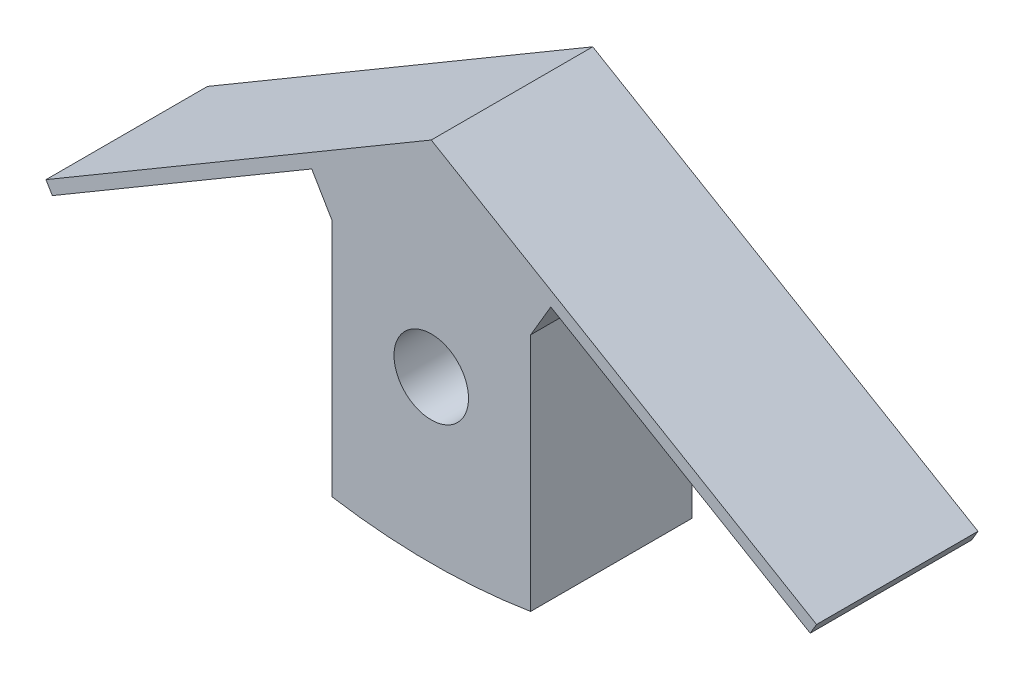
ISO-10303-21;
HEADER;
FILE_DESCRIPTION(('STEP AP214'),'2;1');
FILE_NAME('part.step','',(''),(''),'','','');
FILE_SCHEMA(('AUTOMOTIVE_DESIGN { 1 0 10303 214 1 1 1 1 }'));
ENDSEC;
DATA;
#1=APPLICATION_CONTEXT('core data for automotive mechanical design processes');
#2=APPLICATION_PROTOCOL_DEFINITION('international standard','automotive_design',2000,#1);
#3=PRODUCT_CONTEXT('',#1,'mechanical');
#4=PRODUCT('Part','Part','',(#3));
#5=PRODUCT_RELATED_PRODUCT_CATEGORY('part','',(#4));
#6=PRODUCT_DEFINITION_FORMATION('','',#4);
#7=PRODUCT_DEFINITION_CONTEXT('part definition',#1,'design');
#8=PRODUCT_DEFINITION('design','',#6,#7);
#9=PRODUCT_DEFINITION_SHAPE('','',#8);
#10=(LENGTH_UNIT() NAMED_UNIT(*) SI_UNIT(.MILLI.,.METRE.));
#11=(NAMED_UNIT(*) PLANE_ANGLE_UNIT() SI_UNIT($,.RADIAN.));
#12=(NAMED_UNIT(*) SI_UNIT($,.STERADIAN.) SOLID_ANGLE_UNIT());
#13=UNCERTAINTY_MEASURE_WITH_UNIT(LENGTH_MEASURE(1.E-05),#10,'distance_accuracy_value','');
#14=(GEOMETRIC_REPRESENTATION_CONTEXT(3) GLOBAL_UNCERTAINTY_ASSIGNED_CONTEXT((#13)) GLOBAL_UNIT_ASSIGNED_CONTEXT((#10,
#11,#12)) REPRESENTATION_CONTEXT('',''));
#15=CARTESIAN_POINT('',(0.,0.,0.));
#16=DIRECTION('',(0.,0.,1.));
#17=DIRECTION('',(1.,0.,0.));
#18=AXIS2_PLACEMENT_3D('',#15,#16,#17);
#19=CARTESIAN_POINT('',(0.,-0.482898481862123,13.));
#20=DIRECTION('',(0.507538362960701,-0.861629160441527,0.));
#21=DIRECTION('',(0.861629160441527,0.507538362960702,0.));
#22=AXIS2_PLACEMENT_3D('',#19,#20,#21);
#23=PLANE('',#22);
#24=DIRECTION('',(-0.861629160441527,-0.507538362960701,0.));
#25=VECTOR('',#24,1.);
#26=CARTESIAN_POINT('',(0.,-0.482898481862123,0.));
#27=LINE('',#26,#25);
#28=CARTESIAN_POINT('',(0.,-0.482898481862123,0.));
#29=VERTEX_POINT('',#28);
#30=CARTESIAN_POINT('',(-31.018649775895,-18.7542795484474,0.));
#31=VERTEX_POINT('',#30);
#32=EDGE_CURVE('E148',#29,#31,#27,.T.);
#33=ORIENTED_EDGE('',*,*,#32,.T.);
#34=DIRECTION('',(0.,0.,-1.));
#35=VECTOR('',#34,1.);
#36=CARTESIAN_POINT('',(-31.018649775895,-18.7542795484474,13.));
#37=LINE('',#36,#35);
#38=CARTESIAN_POINT('',(-31.018649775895,-18.7542795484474,13.));
#39=VERTEX_POINT('',#38);
#40=EDGE_CURVE('E11',#39,#31,#37,.T.);
#41=ORIENTED_EDGE('',*,*,#40,.F.);
#42=DIRECTION('',(-0.861629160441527,-0.507538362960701,0.));
#43=VECTOR('',#42,1.);
#44=CARTESIAN_POINT('',(0.,-0.482898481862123,13.));
#45=LINE('',#44,#43);
#46=CARTESIAN_POINT('',(0.,-0.482898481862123,13.));
#47=VERTEX_POINT('',#46);
#48=EDGE_CURVE('E169',#47,#39,#45,.T.);
#49=ORIENTED_EDGE('',*,*,#48,.F.);
#50=DIRECTION('',(0.,0.,-1.));
#51=VECTOR('',#50,1.);
#52=CARTESIAN_POINT('',(0.,-0.482898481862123,13.));
#53=LINE('',#52,#51);
#54=EDGE_CURVE('E144',#47,#29,#53,.T.);
#55=ORIENTED_EDGE('',*,*,#54,.T.);
#56=EDGE_LOOP('',(#33,#41,#49,#55));
#57=FACE_BOUND('',#56,.T.);
#58=ADVANCED_FACE('F33',(#57),#23,.F.);
#59=CARTESIAN_POINT('',(-31.018649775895,-18.7542795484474,13.));
#60=DIRECTION('',(0.861629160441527,0.507538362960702,0.));
#61=DIRECTION('',(-0.507538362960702,0.861629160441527,0.));
#62=AXIS2_PLACEMENT_3D('',#59,#60,#61);
#63=PLANE('',#62);
#64=DIRECTION('',(0.507538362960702,-0.861629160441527,0.));
#65=VECTOR('',#64,1.);
#66=CARTESIAN_POINT('',(-31.018649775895,-18.7542795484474,0.));
#67=LINE('',#66,#65);
#68=CARTESIAN_POINT('',(-30.5111114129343,-19.6159087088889,0.));
#69=VERTEX_POINT('',#68);
#70=EDGE_CURVE('E151',#31,#69,#67,.T.);
#71=ORIENTED_EDGE('',*,*,#70,.T.);
#72=DIRECTION('',(0.,0.,-1.));
#73=VECTOR('',#72,1.);
#74=CARTESIAN_POINT('',(-30.5111114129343,-19.6159087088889,13.));
#75=LINE('',#74,#73);
#76=CARTESIAN_POINT('',(-30.5111114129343,-19.6159087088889,13.));
#77=VERTEX_POINT('',#76);
#78=EDGE_CURVE('E42',#77,#69,#75,.T.);
#79=ORIENTED_EDGE('',*,*,#78,.F.);
#80=DIRECTION('',(0.507538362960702,-0.861629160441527,0.));
#81=VECTOR('',#80,1.);
#82=CARTESIAN_POINT('',(-31.018649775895,-18.7542795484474,13.));
#83=LINE('',#82,#81);
#84=EDGE_CURVE('E102',#39,#77,#83,.T.);
#85=ORIENTED_EDGE('',*,*,#84,.F.);
#86=ORIENTED_EDGE('',*,*,#40,.T.);
#87=EDGE_LOOP('',(#71,#79,#85,#86));
#88=FACE_BOUND('',#87,.T.);
#89=ADVANCED_FACE('F243',(#88),#63,.F.);
#90=CARTESIAN_POINT('',(-30.5111114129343,-19.6159087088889,13.));
#91=DIRECTION('',(-0.507538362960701,0.861629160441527,0.));
#92=DIRECTION('',(-0.861629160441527,-0.507538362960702,0.));
#93=AXIS2_PLACEMENT_3D('',#90,#91,#92);
#94=PLANE('',#93);
#95=DIRECTION('',(0.861629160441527,0.507538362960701,0.));
#96=VECTOR('',#95,1.);
#97=CARTESIAN_POINT('',(-30.5111114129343,-19.6159087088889,0.));
#98=LINE('',#97,#96);
#99=CARTESIAN_POINT('',(-9.62304654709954,-7.31189819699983,0.));
#100=VERTEX_POINT('',#99);
#101=EDGE_CURVE('E154',#69,#100,#98,.T.);
#102=ORIENTED_EDGE('',*,*,#101,.T.);
#103=DIRECTION('',(0.,0.,-1.));
#104=VECTOR('',#103,1.);
#105=CARTESIAN_POINT('',(-9.62304654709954,-7.31189819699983,13.));
#106=LINE('',#105,#104);
#107=CARTESIAN_POINT('',(-9.62304654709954,-7.31189819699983,13.));
#108=VERTEX_POINT('',#107);
#109=EDGE_CURVE('E185',#108,#100,#106,.T.);
#110=ORIENTED_EDGE('',*,*,#109,.F.);
#111=DIRECTION('',(0.861629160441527,0.507538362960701,0.));
#112=VECTOR('',#111,1.);
#113=CARTESIAN_POINT('',(-30.5111114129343,-19.6159087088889,13.));
#114=LINE('',#113,#112);
#115=EDGE_CURVE('E194',#77,#108,#114,.T.);
#116=ORIENTED_EDGE('',*,*,#115,.F.);
#117=ORIENTED_EDGE('',*,*,#78,.T.);
#118=EDGE_LOOP('',(#102,#110,#116,#117));
#119=FACE_BOUND('',#118,.T.);
#120=ADVANCED_FACE('F192',(#119),#94,.F.);
#121=CARTESIAN_POINT('',(-9.62304654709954,-7.31189819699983,13.));
#122=DIRECTION('',(0.861629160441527,0.507538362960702,0.));
#123=DIRECTION('',(-0.507538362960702,0.861629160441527,0.));
#124=AXIS2_PLACEMENT_3D('',#121,#122,#123);
#125=PLANE('',#124);
#126=DIRECTION('',(0.507538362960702,-0.861629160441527,0.));
#127=VECTOR('',#126,1.);
#128=CARTESIAN_POINT('',(-9.62304654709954,-7.31189819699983,0.));
#129=LINE('',#128,#127);
#130=CARTESIAN_POINT('',(-8.,-10.0672844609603,0.));
#131=VERTEX_POINT('',#130);
#132=EDGE_CURVE('E156',#100,#131,#129,.T.);
#133=ORIENTED_EDGE('',*,*,#132,.T.);
#134=DIRECTION('',(0.,0.,-1.));
#135=VECTOR('',#134,1.);
#136=CARTESIAN_POINT('',(-8.,-10.0672844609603,13.));
#137=LINE('',#136,#135);
#138=CARTESIAN_POINT('',(-8.,-10.0672844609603,13.));
#139=VERTEX_POINT('',#138);
#140=EDGE_CURVE('E182',#139,#131,#137,.T.);
#141=ORIENTED_EDGE('',*,*,#140,.F.);
#142=DIRECTION('',(0.507538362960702,-0.861629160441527,0.));
#143=VECTOR('',#142,1.);
#144=CARTESIAN_POINT('',(-9.62304654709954,-7.31189819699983,13.));
#145=LINE('',#144,#143);
#146=EDGE_CURVE('E212',#108,#139,#145,.T.);
#147=ORIENTED_EDGE('',*,*,#146,.F.);
#148=ORIENTED_EDGE('',*,*,#109,.T.);
#149=EDGE_LOOP('',(#133,#141,#147,#148));
#150=FACE_BOUND('',#149,.T.);
#151=ADVANCED_FACE('F203',(#150),#125,.F.);
#152=CARTESIAN_POINT('',(-8.,-10.0672844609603,13.));
#153=DIRECTION('',(1.,0.,0.));
#154=DIRECTION('',(0.,1.,0.));
#155=AXIS2_PLACEMENT_3D('',#152,#153,#154);
#156=PLANE('',#155);
#157=DIRECTION('',(0.,-1.,0.));
#158=VECTOR('',#157,1.);
#159=CARTESIAN_POINT('',(-8.,-10.0672844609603,0.));
#160=LINE('',#159,#158);
#161=CARTESIAN_POINT('',(-8.00000000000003,-29.3558507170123,0.));
#162=VERTEX_POINT('',#161);
#163=EDGE_CURVE('E158',#131,#162,#160,.T.);
#164=ORIENTED_EDGE('',*,*,#163,.T.);
#165=DIRECTION('',(0.,0.,-1.));
#166=VECTOR('',#165,1.);
#167=CARTESIAN_POINT('',(-8.00000000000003,-29.3558507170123,13.));
#168=LINE('',#167,#166);
#169=CARTESIAN_POINT('',(-8.00000000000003,-29.3558507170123,13.));
#170=VERTEX_POINT('',#169);
#171=EDGE_CURVE('E179',#170,#162,#168,.T.);
#172=ORIENTED_EDGE('',*,*,#171,.F.);
#173=DIRECTION('',(0.,-1.,0.));
#174=VECTOR('',#173,1.);
#175=CARTESIAN_POINT('',(-8.,-10.0672844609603,13.));
#176=LINE('',#175,#174);
#177=EDGE_CURVE('E209',#139,#170,#176,.T.);
#178=ORIENTED_EDGE('',*,*,#177,.F.);
#179=ORIENTED_EDGE('',*,*,#140,.T.);
#180=EDGE_LOOP('',(#164,#172,#178,#179));
#181=FACE_BOUND('',#180,.T.);
#182=ADVANCED_FACE('F207',(#181),#156,.F.);
#183=CARTESIAN_POINT('',(0.,20.,13.));
#184=DIRECTION('',(0.,0.,-1.));
#185=DIRECTION('',(-1.,0.,0.));
#186=AXIS2_PLACEMENT_3D('',#183,#184,#185);
#187=CYLINDRICAL_SURFACE('',#186,50.);
#188=CARTESIAN_POINT('',(0.,20.,0.));
#189=DIRECTION('',(0.,0.,1.));
#190=DIRECTION('',(1.,0.,0.));
#191=AXIS2_PLACEMENT_3D('',#188,#189,#190);
#192=CIRCLE('',#191,50.);
#193=CARTESIAN_POINT('',(8.00000000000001,-29.3558507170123,0.));
#194=VERTEX_POINT('',#193);
#195=EDGE_CURVE('E160',#162,#194,#192,.T.);
#196=ORIENTED_EDGE('',*,*,#195,.T.);
#197=DIRECTION('',(0.,0.,-1.));
#198=VECTOR('',#197,1.);
#199=CARTESIAN_POINT('',(8.00000000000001,-29.3558507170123,13.));
#200=LINE('',#199,#198);
#201=CARTESIAN_POINT('',(8.00000000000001,-29.3558507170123,13.));
#202=VERTEX_POINT('',#201);
#203=EDGE_CURVE('E176',#202,#194,#200,.T.);
#204=ORIENTED_EDGE('',*,*,#203,.F.);
#205=CARTESIAN_POINT('',(0.,20.,13.));
#206=DIRECTION('',(0.,0.,1.));
#207=DIRECTION('',(1.,0.,0.));
#208=AXIS2_PLACEMENT_3D('',#205,#206,#207);
#209=CIRCLE('',#208,50.);
#210=EDGE_CURVE('E211',#170,#202,#209,.T.);
#211=ORIENTED_EDGE('',*,*,#210,.F.);
#212=ORIENTED_EDGE('',*,*,#171,.T.);
#213=EDGE_LOOP('',(#196,#204,#211,#212));
#214=FACE_BOUND('',#213,.T.);
#215=ADVANCED_FACE('F256',(#214),#187,.T.);
#216=CARTESIAN_POINT('',(8.,-10.0672844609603,13.));
#217=DIRECTION('',(-1.,0.,0.));
#218=DIRECTION('',(0.,-1.,0.));
#219=AXIS2_PLACEMENT_3D('',#216,#217,#218);
#220=PLANE('',#219);
#221=DIRECTION('',(0.,1.,0.));
#222=VECTOR('',#221,1.);
#223=CARTESIAN_POINT('',(8.,-10.0672844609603,0.));
#224=LINE('',#223,#222);
#225=CARTESIAN_POINT('',(8.,-10.0672844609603,0.));
#226=VERTEX_POINT('',#225);
#227=EDGE_CURVE('E162',#194,#226,#224,.T.);
#228=ORIENTED_EDGE('',*,*,#227,.T.);
#229=DIRECTION('',(0.,0.,-1.));
#230=VECTOR('',#229,1.);
#231=CARTESIAN_POINT('',(8.,-10.0672844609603,13.));
#232=LINE('',#231,#230);
#233=CARTESIAN_POINT('',(8.,-10.0672844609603,13.));
#234=VERTEX_POINT('',#233);
#235=EDGE_CURVE('E173',#234,#226,#232,.T.);
#236=ORIENTED_EDGE('',*,*,#235,.F.);
#237=DIRECTION('',(0.,1.,0.));
#238=VECTOR('',#237,1.);
#239=CARTESIAN_POINT('',(8.,-10.0672844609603,13.));
#240=LINE('',#239,#238);
#241=EDGE_CURVE('E214',#202,#234,#240,.T.);
#242=ORIENTED_EDGE('',*,*,#241,.F.);
#243=ORIENTED_EDGE('',*,*,#203,.T.);
#244=EDGE_LOOP('',(#228,#236,#242,#243));
#245=FACE_BOUND('',#244,.T.);
#246=ADVANCED_FACE('F223',(#245),#220,.F.);
#247=CARTESIAN_POINT('',(9.62304654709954,-7.31189819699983,13.));
#248=DIRECTION('',(-0.861629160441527,0.507538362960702,0.));
#249=DIRECTION('',(-0.507538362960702,-0.861629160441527,0.));
#250=AXIS2_PLACEMENT_3D('',#247,#248,#249);
#251=PLANE('',#250);
#252=DIRECTION('',(0.507538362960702,0.861629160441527,0.));
#253=VECTOR('',#252,1.);
#254=CARTESIAN_POINT('',(9.62304654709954,-7.31189819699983,0.));
#255=LINE('',#254,#253);
#256=CARTESIAN_POINT('',(9.62304654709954,-7.31189819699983,0.));
#257=VERTEX_POINT('',#256);
#258=EDGE_CURVE('E164',#226,#257,#255,.T.);
#259=ORIENTED_EDGE('',*,*,#258,.T.);
#260=DIRECTION('',(0.,0.,-1.));
#261=VECTOR('',#260,1.);
#262=CARTESIAN_POINT('',(9.62304654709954,-7.31189819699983,13.));
#263=LINE('',#262,#261);
#264=CARTESIAN_POINT('',(9.62304654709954,-7.31189819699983,13.));
#265=VERTEX_POINT('',#264);
#266=EDGE_CURVE('E139',#265,#257,#263,.T.);
#267=ORIENTED_EDGE('',*,*,#266,.F.);
#268=DIRECTION('',(0.507538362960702,0.861629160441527,0.));
#269=VECTOR('',#268,1.);
#270=CARTESIAN_POINT('',(9.62304654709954,-7.31189819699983,13.));
#271=LINE('',#270,#269);
#272=EDGE_CURVE('E130',#234,#265,#271,.T.);
#273=ORIENTED_EDGE('',*,*,#272,.F.);
#274=ORIENTED_EDGE('',*,*,#235,.T.);
#275=EDGE_LOOP('',(#259,#267,#273,#274));
#276=FACE_BOUND('',#275,.T.);
#277=ADVANCED_FACE('F227',(#276),#251,.F.);
#278=CARTESIAN_POINT('',(30.5111114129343,-19.6159087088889,13.));
#279=DIRECTION('',(0.507538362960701,0.861629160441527,0.));
#280=DIRECTION('',(-0.861629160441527,0.507538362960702,0.));
#281=AXIS2_PLACEMENT_3D('',#278,#279,#280);
#282=PLANE('',#281);
#283=DIRECTION('',(0.861629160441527,-0.507538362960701,0.));
#284=VECTOR('',#283,1.);
#285=CARTESIAN_POINT('',(30.5111114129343,-19.6159087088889,0.));
#286=LINE('',#285,#284);
#287=CARTESIAN_POINT('',(30.5111114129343,-19.6159087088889,0.));
#288=VERTEX_POINT('',#287);
#289=EDGE_CURVE('E138',#257,#288,#286,.T.);
#290=ORIENTED_EDGE('',*,*,#289,.T.);
#291=DIRECTION('',(0.,0.,-1.));
#292=VECTOR('',#291,1.);
#293=CARTESIAN_POINT('',(30.5111114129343,-19.6159087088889,13.));
#294=LINE('',#293,#292);
#295=CARTESIAN_POINT('',(30.5111114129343,-19.6159087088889,13.));
#296=VERTEX_POINT('',#295);
#297=EDGE_CURVE('E135',#296,#288,#294,.T.);
#298=ORIENTED_EDGE('',*,*,#297,.F.);
#299=DIRECTION('',(0.861629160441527,-0.507538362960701,0.));
#300=VECTOR('',#299,1.);
#301=CARTESIAN_POINT('',(30.5111114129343,-19.6159087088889,13.));
#302=LINE('',#301,#300);
#303=EDGE_CURVE('E124',#265,#296,#302,.T.);
#304=ORIENTED_EDGE('',*,*,#303,.F.);
#305=ORIENTED_EDGE('',*,*,#266,.T.);
#306=EDGE_LOOP('',(#290,#298,#304,#305));
#307=FACE_BOUND('',#306,.T.);
#308=ADVANCED_FACE('F136',(#307),#282,.F.);
#309=CARTESIAN_POINT('',(31.018649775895,-18.7542795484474,13.));
#310=DIRECTION('',(-0.861629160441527,0.507538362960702,0.));
#311=DIRECTION('',(-0.507538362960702,-0.861629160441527,0.));
#312=AXIS2_PLACEMENT_3D('',#309,#310,#311);
#313=PLANE('',#312);
#314=DIRECTION('',(0.507538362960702,0.861629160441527,0.));
#315=VECTOR('',#314,1.);
#316=CARTESIAN_POINT('',(31.018649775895,-18.7542795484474,0.));
#317=LINE('',#316,#315);
#318=CARTESIAN_POINT('',(31.018649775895,-18.7542795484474,0.));
#319=VERTEX_POINT('',#318);
#320=EDGE_CURVE('E88',#288,#319,#317,.T.);
#321=ORIENTED_EDGE('',*,*,#320,.T.);
#322=DIRECTION('',(0.,0.,-1.));
#323=VECTOR('',#322,1.);
#324=CARTESIAN_POINT('',(31.018649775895,-18.7542795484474,13.));
#325=LINE('',#324,#323);
#326=CARTESIAN_POINT('',(31.018649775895,-18.7542795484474,13.));
#327=VERTEX_POINT('',#326);
#328=EDGE_CURVE('E140',#327,#319,#325,.T.);
#329=ORIENTED_EDGE('',*,*,#328,.F.);
#330=DIRECTION('',(0.507538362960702,0.861629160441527,0.));
#331=VECTOR('',#330,1.);
#332=CARTESIAN_POINT('',(31.018649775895,-18.7542795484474,13.));
#333=LINE('',#332,#331);
#334=EDGE_CURVE('E128',#296,#327,#333,.T.);
#335=ORIENTED_EDGE('',*,*,#334,.F.);
#336=ORIENTED_EDGE('',*,*,#297,.T.);
#337=EDGE_LOOP('',(#321,#329,#335,#336));
#338=FACE_BOUND('',#337,.T.);
#339=ADVANCED_FACE('F142',(#338),#313,.F.);
#340=CARTESIAN_POINT('',(0.,-0.482898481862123,13.));
#341=DIRECTION('',(-0.507538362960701,-0.861629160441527,0.));
#342=DIRECTION('',(0.861629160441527,-0.507538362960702,0.));
#343=AXIS2_PLACEMENT_3D('',#340,#341,#342);
#344=PLANE('',#343);
#345=DIRECTION('',(-0.861629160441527,0.507538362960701,0.));
#346=VECTOR('',#345,1.);
#347=CARTESIAN_POINT('',(0.,-0.482898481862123,0.));
#348=LINE('',#347,#346);
#349=EDGE_CURVE('E94',#319,#29,#348,.T.);
#350=ORIENTED_EDGE('',*,*,#349,.T.);
#351=ORIENTED_EDGE('',*,*,#54,.F.);
#352=DIRECTION('',(-0.861629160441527,0.507538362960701,0.));
#353=VECTOR('',#352,1.);
#354=CARTESIAN_POINT('',(0.,-0.482898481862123,13.));
#355=LINE('',#354,#353);
#356=EDGE_CURVE('E50',#327,#47,#355,.T.);
#357=ORIENTED_EDGE('',*,*,#356,.F.);
#358=ORIENTED_EDGE('',*,*,#328,.T.);
#359=EDGE_LOOP('',(#350,#351,#357,#358));
#360=FACE_BOUND('',#359,.T.);
#361=ADVANCED_FACE('F231',(#360),#344,.F.);
#362=CARTESIAN_POINT('',(0.,20.,13.));
#363=DIRECTION('',(0.,0.,1.));
#364=DIRECTION('',(1.,0.,0.));
#365=AXIS2_PLACEMENT_3D('',#362,#363,#364);
#366=PLANE('',#365);
#367=CARTESIAN_POINT('',(0.,-17.,13.));
#368=DIRECTION('',(0.,0.,-1.));
#369=DIRECTION('',(-1.,0.,0.));
#370=AXIS2_PLACEMENT_3D('',#367,#368,#369);
#371=CIRCLE('',#370,3.);
#372=CARTESIAN_POINT('',(-3.,-17.,13.));
#373=VERTEX_POINT('',#372);
#374=EDGE_CURVE('E328',#373,#373,#371,.T.);
#375=ORIENTED_EDGE('',*,*,#374,.T.);
#376=EDGE_LOOP('',(#375));
#377=FACE_BOUND('',#376,.T.);
#378=ORIENTED_EDGE('',*,*,#48,.T.);
#379=ORIENTED_EDGE('',*,*,#84,.T.);
#380=ORIENTED_EDGE('',*,*,#115,.T.);
#381=ORIENTED_EDGE('',*,*,#146,.T.);
#382=ORIENTED_EDGE('',*,*,#177,.T.);
#383=ORIENTED_EDGE('',*,*,#210,.T.);
#384=ORIENTED_EDGE('',*,*,#241,.T.);
#385=ORIENTED_EDGE('',*,*,#272,.T.);
#386=ORIENTED_EDGE('',*,*,#303,.T.);
#387=ORIENTED_EDGE('',*,*,#334,.T.);
#388=ORIENTED_EDGE('',*,*,#356,.T.);
#389=EDGE_LOOP('',(#378,#379,#380,#381,#382,#383,#384,#385,#386,#387,#388));
#390=FACE_BOUND('',#389,.T.);
#391=ADVANCED_FACE('F126',(#377,#390),#366,.T.);
#392=CARTESIAN_POINT('',(0.,20.,0.));
#393=DIRECTION('',(0.,0.,1.));
#394=DIRECTION('',(1.,0.,0.));
#395=AXIS2_PLACEMENT_3D('',#392,#393,#394);
#396=PLANE('',#395);
#397=CARTESIAN_POINT('',(0.,-17.,0.));
#398=DIRECTION('',(0.,0.,1.));
#399=DIRECTION('',(1.,0.,0.));
#400=AXIS2_PLACEMENT_3D('',#397,#398,#399);
#401=CIRCLE('',#400,3.);
#402=CARTESIAN_POINT('',(-3.,-17.,0.));
#403=VERTEX_POINT('',#402);
#404=EDGE_CURVE('E36',#403,#403,#401,.T.);
#405=ORIENTED_EDGE('',*,*,#404,.T.);
#406=EDGE_LOOP('',(#405));
#407=FACE_BOUND('',#406,.T.);
#408=CARTESIAN_POINT('',(0.,-26.,0.));
#409=DIRECTION('',(0.,0.,1.));
#410=DIRECTION('',(1.,0.,0.));
#411=AXIS2_PLACEMENT_3D('',#408,#409,#410);
#412=CIRCLE('',#411,2.);
#413=CARTESIAN_POINT('',(2.,-26.,0.));
#414=VERTEX_POINT('',#413);
#415=EDGE_CURVE('E331',#414,#414,#412,.T.);
#416=ORIENTED_EDGE('',*,*,#415,.T.);
#417=EDGE_LOOP('',(#416));
#418=FACE_BOUND('',#417,.T.);
#419=ORIENTED_EDGE('',*,*,#32,.F.);
#420=ORIENTED_EDGE('',*,*,#349,.F.);
#421=ORIENTED_EDGE('',*,*,#320,.F.);
#422=ORIENTED_EDGE('',*,*,#289,.F.);
#423=ORIENTED_EDGE('',*,*,#258,.F.);
#424=ORIENTED_EDGE('',*,*,#227,.F.);
#425=ORIENTED_EDGE('',*,*,#195,.F.);
#426=ORIENTED_EDGE('',*,*,#163,.F.);
#427=ORIENTED_EDGE('',*,*,#132,.F.);
#428=ORIENTED_EDGE('',*,*,#101,.F.);
#429=ORIENTED_EDGE('',*,*,#70,.F.);
#430=EDGE_LOOP('',(#419,#420,#421,#422,#423,#424,#425,#426,#427,#428,#429));
#431=FACE_BOUND('',#430,.T.);
#432=ADVANCED_FACE('F198',(#407,#418,#431),#396,.F.);
#433=CARTESIAN_POINT('',(0.,-26.,-13.));
#434=DIRECTION('',(0.,0.,1.));
#435=DIRECTION('',(1.,0.,0.));
#436=AXIS2_PLACEMENT_3D('',#433,#434,#435);
#437=CYLINDRICAL_SURFACE('',#436,2.);
#438=CARTESIAN_POINT('',(0.,-26.,-13.));
#439=DIRECTION('',(0.,0.,1.));
#440=DIRECTION('',(1.,0.,0.));
#441=AXIS2_PLACEMENT_3D('',#438,#439,#440);
#442=CIRCLE('',#441,2.);
#443=CARTESIAN_POINT('',(2.,-26.,-13.));
#444=VERTEX_POINT('',#443);
#445=EDGE_CURVE('E152',#444,#444,#442,.T.);
#446=CARTESIAN_POINT('',(2.,-26.,-13.));
#447=CARTESIAN_POINT('',(2.,-26.,-12.8645833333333));
#448=CARTESIAN_POINT('',(2.,-26.,-12.7291666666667));
#449=CARTESIAN_POINT('',(2.,-26.,-12.4583333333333));
#450=CARTESIAN_POINT('',(2.,-26.,-12.3229166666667));
#451=CARTESIAN_POINT('',(2.,-26.,-12.0520833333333));
#452=CARTESIAN_POINT('',(2.,-26.,-11.9166666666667));
#453=CARTESIAN_POINT('',(2.,-26.,-11.6458333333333));
#454=CARTESIAN_POINT('',(2.,-26.,-11.5104166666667));
#455=CARTESIAN_POINT('',(2.,-26.,-11.2395833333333));
#456=CARTESIAN_POINT('',(2.,-26.,-11.1041666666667));
#457=CARTESIAN_POINT('',(2.,-26.,-10.8333333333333));
#458=CARTESIAN_POINT('',(2.,-26.,-10.6979166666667));
#459=CARTESIAN_POINT('',(2.,-26.,-10.4270833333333));
#460=CARTESIAN_POINT('',(2.,-26.,-10.2916666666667));
#461=CARTESIAN_POINT('',(2.,-26.,-10.0208333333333));
#462=CARTESIAN_POINT('',(2.,-26.,-9.88541666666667));
#463=CARTESIAN_POINT('',(2.,-26.,-9.61458333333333));
#464=CARTESIAN_POINT('',(2.,-26.,-9.47916666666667));
#465=CARTESIAN_POINT('',(2.,-26.,-9.20833333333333));
#466=CARTESIAN_POINT('',(2.,-26.,-9.07291666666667));
#467=CARTESIAN_POINT('',(2.,-26.,-8.80208333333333));
#468=CARTESIAN_POINT('',(2.,-26.,-8.66666666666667));
#469=CARTESIAN_POINT('',(2.,-26.,-8.39583333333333));
#470=CARTESIAN_POINT('',(2.,-26.,-8.26041666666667));
#471=CARTESIAN_POINT('',(2.,-26.,-7.98958333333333));
#472=CARTESIAN_POINT('',(2.,-26.,-7.85416666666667));
#473=CARTESIAN_POINT('',(2.,-26.,-7.58333333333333));
#474=CARTESIAN_POINT('',(2.,-26.,-7.44791666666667));
#475=CARTESIAN_POINT('',(2.,-26.,-7.17708333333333));
#476=CARTESIAN_POINT('',(2.,-26.,-7.04166666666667));
#477=CARTESIAN_POINT('',(2.,-26.,-6.77083333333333));
#478=CARTESIAN_POINT('',(2.,-26.,-6.63541666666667));
#479=CARTESIAN_POINT('',(2.,-26.,-6.36458333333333));
#480=CARTESIAN_POINT('',(2.,-26.,-6.22916666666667));
#481=CARTESIAN_POINT('',(2.,-26.,-5.95833333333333));
#482=CARTESIAN_POINT('',(2.,-26.,-5.82291666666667));
#483=CARTESIAN_POINT('',(2.,-26.,-5.55208333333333));
#484=CARTESIAN_POINT('',(2.,-26.,-5.41666666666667));
#485=CARTESIAN_POINT('',(2.,-26.,-5.14583333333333));
#486=CARTESIAN_POINT('',(2.,-26.,-5.01041666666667));
#487=CARTESIAN_POINT('',(2.,-26.,-4.73958333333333));
#488=CARTESIAN_POINT('',(2.,-26.,-4.60416666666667));
#489=CARTESIAN_POINT('',(2.,-26.,-4.33333333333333));
#490=CARTESIAN_POINT('',(2.,-26.,-4.19791666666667));
#491=CARTESIAN_POINT('',(2.,-26.,-3.92708333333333));
#492=CARTESIAN_POINT('',(2.,-26.,-3.79166666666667));
#493=CARTESIAN_POINT('',(2.,-26.,-3.52083333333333));
#494=CARTESIAN_POINT('',(2.,-26.,-3.38541666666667));
#495=CARTESIAN_POINT('',(2.,-26.,-3.11458333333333));
#496=CARTESIAN_POINT('',(2.,-26.,-2.97916666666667));
#497=CARTESIAN_POINT('',(2.,-26.,-2.70833333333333));
#498=CARTESIAN_POINT('',(2.,-26.,-2.57291666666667));
#499=CARTESIAN_POINT('',(2.,-26.,-2.30208333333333));
#500=CARTESIAN_POINT('',(2.,-26.,-2.16666666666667));
#501=CARTESIAN_POINT('',(2.,-26.,-1.89583333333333));
#502=CARTESIAN_POINT('',(2.,-26.,-1.76041666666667));
#503=CARTESIAN_POINT('',(2.,-26.,-1.48958333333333));
#504=CARTESIAN_POINT('',(2.,-26.,-1.35416666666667));
#505=CARTESIAN_POINT('',(2.,-26.,-1.08333333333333));
#506=CARTESIAN_POINT('',(2.,-26.,-0.947916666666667));
#507=CARTESIAN_POINT('',(2.,-26.,-0.677083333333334));
#508=CARTESIAN_POINT('',(2.,-26.,-0.541666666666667));
#509=CARTESIAN_POINT('',(2.,-26.,-0.270833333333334));
#510=CARTESIAN_POINT('',(2.,-26.,-0.135416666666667));
#511=CARTESIAN_POINT('',(2.,-26.,0.));
#512=B_SPLINE_CURVE_WITH_KNOTS('',3,(#446,#447,#448,#449,#450,#451,#452,#453,#454,#455,#456,
#457,#458,#459,#460,#461,#462,#463,#464,#465,#466,#467,#468,#469,#470,#471,#472,#473,#474,#475,
#476,#477,#478,#479,#480,#481,#482,#483,#484,#485,#486,#487,#488,#489,#490,#491,#492,#493,#494,
#495,#496,#497,#498,#499,#500,#501,#502,#503,#504,#505,#506,#507,#508,#509,#510,#511),
.UNSPECIFIED.,.F.,.F.,(4,2,2,2,2,2,2,2,2,2,2,2,2,2,2,2,2,2,2,2,2,2,2,2,2,2,2,2,2,2,2,2,4),(0.,
0.40625,0.812500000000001,1.21875,1.625,2.03125,2.4375,2.84375,3.25,3.65625,4.0625,4.46875,
4.875,5.28125,5.6875,6.09375,6.5,6.90625,7.3125,7.71875,8.125,8.53125,8.9375,9.34375,9.75,
10.15625,10.5625,10.96875,11.375,11.78125,12.1875,12.59375,13.),.UNSPECIFIED.);
#513=EDGE_CURVE('BSEAM283',#444,#414,#512,.T.);
#514=ORIENTED_EDGE('',*,*,#445,.T.);
#515=ORIENTED_EDGE('',*,*,#415,.F.);
#516=ORIENTED_EDGE('',*,*,#513,.T.);
#517=ORIENTED_EDGE('',*,*,#513,.F.);
#518=EDGE_LOOP('',(#514,#516,#515,#517));
#519=FACE_BOUND('',#518,.T.);
#520=ADVANCED_FACE('F283',(#519),#437,.T.);
#521=CARTESIAN_POINT('',(0.,-26.,-13.));
#522=DIRECTION('',(0.,0.,1.));
#523=DIRECTION('',(1.,0.,0.));
#524=AXIS2_PLACEMENT_3D('',#521,#522,#523);
#525=PLANE('',#524);
#526=ORIENTED_EDGE('',*,*,#445,.F.);
#527=EDGE_LOOP('',(#526));
#528=FACE_BOUND('',#527,.T.);
#529=ADVANCED_FACE('F288',(#528),#525,.F.);
#530=CARTESIAN_POINT('',(0.,-17.,13.));
#531=DIRECTION('',(0.,0.,-1.));
#532=DIRECTION('',(-1.,0.,0.));
#533=AXIS2_PLACEMENT_3D('',#530,#531,#532);
#534=CYLINDRICAL_SURFACE('',#533,3.);
#535=CARTESIAN_POINT('',(-3.,-17.,13.));
#536=CARTESIAN_POINT('',(-3.,-17.,12.8645833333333));
#537=CARTESIAN_POINT('',(-3.,-17.,12.7291666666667));
#538=CARTESIAN_POINT('',(-3.,-17.,12.4583333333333));
#539=CARTESIAN_POINT('',(-3.,-17.,12.3229166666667));
#540=CARTESIAN_POINT('',(-3.,-17.,12.0520833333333));
#541=CARTESIAN_POINT('',(-3.,-17.,11.9166666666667));
#542=CARTESIAN_POINT('',(-3.,-17.,11.6458333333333));
#543=CARTESIAN_POINT('',(-3.,-17.,11.5104166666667));
#544=CARTESIAN_POINT('',(-3.,-17.,11.2395833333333));
#545=CARTESIAN_POINT('',(-3.,-17.,11.1041666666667));
#546=CARTESIAN_POINT('',(-3.,-17.,10.8333333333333));
#547=CARTESIAN_POINT('',(-3.,-17.,10.6979166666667));
#548=CARTESIAN_POINT('',(-3.,-17.,10.4270833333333));
#549=CARTESIAN_POINT('',(-3.,-17.,10.2916666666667));
#550=CARTESIAN_POINT('',(-3.,-17.,10.0208333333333));
#551=CARTESIAN_POINT('',(-3.,-17.,9.88541666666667));
#552=CARTESIAN_POINT('',(-3.,-17.,9.61458333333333));
#553=CARTESIAN_POINT('',(-3.,-17.,9.47916666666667));
#554=CARTESIAN_POINT('',(-3.,-17.,9.20833333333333));
#555=CARTESIAN_POINT('',(-3.,-17.,9.07291666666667));
#556=CARTESIAN_POINT('',(-3.,-17.,8.80208333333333));
#557=CARTESIAN_POINT('',(-3.,-17.,8.66666666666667));
#558=CARTESIAN_POINT('',(-3.,-17.,8.39583333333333));
#559=CARTESIAN_POINT('',(-3.,-17.,8.26041666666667));
#560=CARTESIAN_POINT('',(-3.,-17.,7.98958333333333));
#561=CARTESIAN_POINT('',(-3.,-17.,7.85416666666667));
#562=CARTESIAN_POINT('',(-3.,-17.,7.58333333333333));
#563=CARTESIAN_POINT('',(-3.,-17.,7.44791666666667));
#564=CARTESIAN_POINT('',(-3.,-17.,7.17708333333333));
#565=CARTESIAN_POINT('',(-3.,-17.,7.04166666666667));
#566=CARTESIAN_POINT('',(-3.,-17.,6.77083333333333));
#567=CARTESIAN_POINT('',(-3.,-17.,6.63541666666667));
#568=CARTESIAN_POINT('',(-3.,-17.,6.36458333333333));
#569=CARTESIAN_POINT('',(-3.,-17.,6.22916666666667));
#570=CARTESIAN_POINT('',(-3.,-17.,5.95833333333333));
#571=CARTESIAN_POINT('',(-3.,-17.,5.82291666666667));
#572=CARTESIAN_POINT('',(-3.,-17.,5.55208333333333));
#573=CARTESIAN_POINT('',(-3.,-17.,5.41666666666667));
#574=CARTESIAN_POINT('',(-3.,-17.,5.14583333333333));
#575=CARTESIAN_POINT('',(-3.,-17.,5.01041666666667));
#576=CARTESIAN_POINT('',(-3.,-17.,4.73958333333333));
#577=CARTESIAN_POINT('',(-3.,-17.,4.60416666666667));
#578=CARTESIAN_POINT('',(-3.,-17.,4.33333333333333));
#579=CARTESIAN_POINT('',(-3.,-17.,4.19791666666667));
#580=CARTESIAN_POINT('',(-3.,-17.,3.92708333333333));
#581=CARTESIAN_POINT('',(-3.,-17.,3.79166666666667));
#582=CARTESIAN_POINT('',(-3.,-17.,3.52083333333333));
#583=CARTESIAN_POINT('',(-3.,-17.,3.38541666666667));
#584=CARTESIAN_POINT('',(-3.,-17.,3.11458333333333));
#585=CARTESIAN_POINT('',(-3.,-17.,2.97916666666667));
#586=CARTESIAN_POINT('',(-3.,-17.,2.70833333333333));
#587=CARTESIAN_POINT('',(-3.,-17.,2.57291666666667));
#588=CARTESIAN_POINT('',(-3.,-17.,2.30208333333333));
#589=CARTESIAN_POINT('',(-3.,-17.,2.16666666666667));
#590=CARTESIAN_POINT('',(-3.,-17.,1.89583333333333));
#591=CARTESIAN_POINT('',(-3.,-17.,1.76041666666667));
#592=CARTESIAN_POINT('',(-3.,-17.,1.48958333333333));
#593=CARTESIAN_POINT('',(-3.,-17.,1.35416666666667));
#594=CARTESIAN_POINT('',(-3.,-17.,1.08333333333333));
#595=CARTESIAN_POINT('',(-3.,-17.,0.947916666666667));
#596=CARTESIAN_POINT('',(-3.,-17.,0.677083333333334));
#597=CARTESIAN_POINT('',(-3.,-17.,0.541666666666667));
#598=CARTESIAN_POINT('',(-3.,-17.,0.270833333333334));
#599=CARTESIAN_POINT('',(-3.,-17.,0.135416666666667));
#600=CARTESIAN_POINT('',(-3.,-17.,0.));
#601=B_SPLINE_CURVE_WITH_KNOTS('',3,(#535,#536,#537,#538,#539,#540,#541,#542,#543,#544,#545,
#546,#547,#548,#549,#550,#551,#552,#553,#554,#555,#556,#557,#558,#559,#560,#561,#562,#563,#564,
#565,#566,#567,#568,#569,#570,#571,#572,#573,#574,#575,#576,#577,#578,#579,#580,#581,#582,#583,
#584,#585,#586,#587,#588,#589,#590,#591,#592,#593,#594,#595,#596,#597,#598,#599,#600),
.UNSPECIFIED.,.F.,.F.,(4,2,2,2,2,2,2,2,2,2,2,2,2,2,2,2,2,2,2,2,2,2,2,2,2,2,2,2,2,2,2,2,4),(0.,
0.406249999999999,0.812499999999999,1.21875,1.625,2.03125,2.4375,2.84375,3.25,3.65625,4.0625,
4.46875,4.875,5.28125,5.6875,6.09375,6.5,6.90625,7.3125,7.71875,8.125,8.53125,8.9375,9.34375,
9.75,10.15625,10.5625,10.96875,11.375,11.78125,12.1875,12.59375,13.),.UNSPECIFIED.);
#602=EDGE_CURVE('BSEAM300',#373,#403,#601,.T.);
#603=ORIENTED_EDGE('',*,*,#374,.F.);
#604=ORIENTED_EDGE('',*,*,#404,.F.);
#605=ORIENTED_EDGE('',*,*,#602,.T.);
#606=ORIENTED_EDGE('',*,*,#602,.F.);
#607=EDGE_LOOP('',(#603,#605,#604,#606));
#608=FACE_BOUND('',#607,.T.);
#609=ADVANCED_FACE('F300',(#608),#534,.F.);
#610=CLOSED_SHELL('',(#58,#89,#120,#151,#182,#215,#246,#277,#308,#339,#361,#391,#432,#520,#529,#609));
#611=MANIFOLD_SOLID_BREP('B2',#610);
#612=ADVANCED_BREP_SHAPE_REPRESENTATION('',(#18,#611),#14);
#613=SHAPE_DEFINITION_REPRESENTATION(#9,#612);
ENDSEC;
END-ISO-10303-21;
